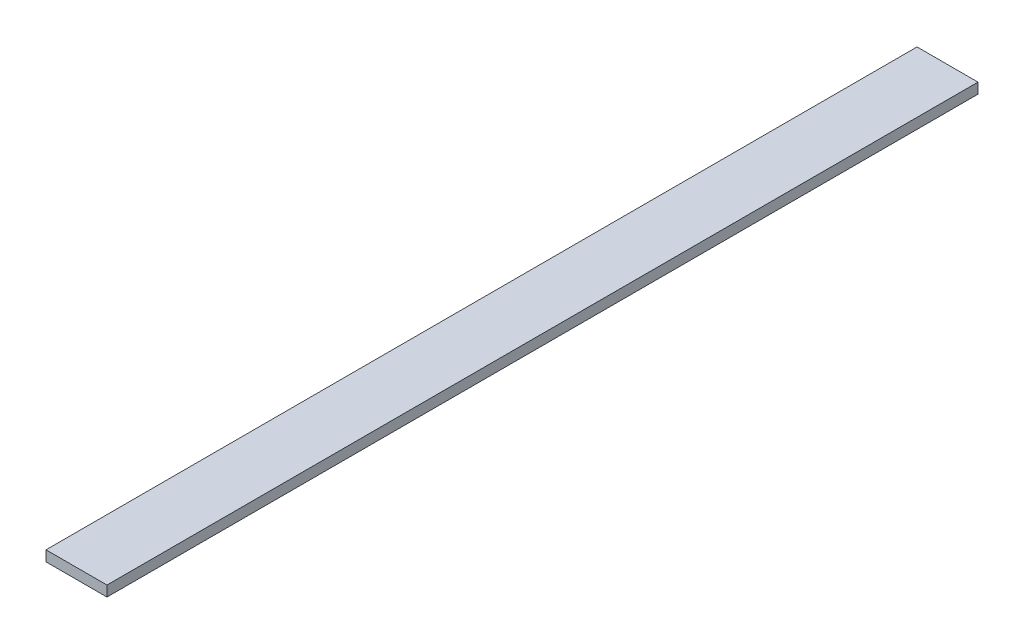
ISO-10303-21;
HEADER;
FILE_DESCRIPTION(('STEP AP214'),'2;1');
FILE_NAME('part.step','',(''),(''),'','','');
FILE_SCHEMA(('AUTOMOTIVE_DESIGN { 1 0 10303 214 1 1 1 1 }'));
ENDSEC;
DATA;
#1=APPLICATION_CONTEXT('core data for automotive mechanical design processes');
#2=APPLICATION_PROTOCOL_DEFINITION('international standard','automotive_design',2000,#1);
#3=PRODUCT_CONTEXT('',#1,'mechanical');
#4=PRODUCT('Part','Part','',(#3));
#5=PRODUCT_RELATED_PRODUCT_CATEGORY('part','',(#4));
#6=PRODUCT_DEFINITION_FORMATION('','',#4);
#7=PRODUCT_DEFINITION_CONTEXT('part definition',#1,'design');
#8=PRODUCT_DEFINITION('design','',#6,#7);
#9=PRODUCT_DEFINITION_SHAPE('','',#8);
#10=(LENGTH_UNIT() NAMED_UNIT(*) SI_UNIT(.MILLI.,.METRE.));
#11=(NAMED_UNIT(*) PLANE_ANGLE_UNIT() SI_UNIT($,.RADIAN.));
#12=(NAMED_UNIT(*) SI_UNIT($,.STERADIAN.) SOLID_ANGLE_UNIT());
#13=UNCERTAINTY_MEASURE_WITH_UNIT(LENGTH_MEASURE(1.E-05),#10,'distance_accuracy_value','');
#14=(GEOMETRIC_REPRESENTATION_CONTEXT(3) GLOBAL_UNCERTAINTY_ASSIGNED_CONTEXT((#13)) GLOBAL_UNIT_ASSIGNED_CONTEXT((#10,
#11,#12)) REPRESENTATION_CONTEXT('',''));
#15=CARTESIAN_POINT('',(0.,0.,0.));
#16=DIRECTION('',(0.,0.,1.));
#17=DIRECTION('',(1.,0.,0.));
#18=AXIS2_PLACEMENT_3D('',#15,#16,#17);
#19=CARTESIAN_POINT('',(17.5,0.,0.));
#20=DIRECTION('',(-1.,0.,0.));
#21=DIRECTION('',(0.,0.,1.));
#22=AXIS2_PLACEMENT_3D('',#19,#20,#21);
#23=PLANE('',#22);
#24=DIRECTION('',(0.,-1.,0.));
#25=VECTOR('',#24,1.);
#26=CARTESIAN_POINT('',(17.5,3.,0.));
#27=LINE('',#26,#25);
#28=CARTESIAN_POINT('',(17.5,6.,0.));
#29=VERTEX_POINT('',#28);
#30=CARTESIAN_POINT('',(17.5,0.,0.));
#31=VERTEX_POINT('',#30);
#32=EDGE_CURVE('E51',#29,#31,#27,.T.);
#33=ORIENTED_EDGE('',*,*,#32,.F.);
#34=DIRECTION('',(0.,0.,-1.));
#35=VECTOR('',#34,1.);
#36=CARTESIAN_POINT('',(17.5,6.,250.));
#37=LINE('',#36,#35);
#38=CARTESIAN_POINT('',(17.5,6.,500.));
#39=VERTEX_POINT('',#38);
#40=EDGE_CURVE('E66',#39,#29,#37,.T.);
#41=ORIENTED_EDGE('',*,*,#40,.F.);
#42=DIRECTION('',(0.,-1.,0.));
#43=VECTOR('',#42,1.);
#44=CARTESIAN_POINT('',(17.5,3.,500.));
#45=LINE('',#44,#43);
#46=CARTESIAN_POINT('',(17.5,0.,500.));
#47=VERTEX_POINT('',#46);
#48=EDGE_CURVE('E18',#39,#47,#45,.T.);
#49=ORIENTED_EDGE('',*,*,#48,.T.);
#50=DIRECTION('',(0.,0.,1.));
#51=VECTOR('',#50,1.);
#52=CARTESIAN_POINT('',(17.5,0.,250.));
#53=LINE('',#52,#51);
#54=EDGE_CURVE('E56',#31,#47,#53,.T.);
#55=ORIENTED_EDGE('',*,*,#54,.F.);
#56=EDGE_LOOP('',(#33,#41,#49,#55));
#57=FACE_BOUND('',#56,.T.);
#58=ADVANCED_FACE('F14',(#57),#23,.F.);
#59=CARTESIAN_POINT('',(17.5,0.,500.));
#60=DIRECTION('',(0.,0.,-1.));
#61=DIRECTION('',(-1.,0.,0.));
#62=AXIS2_PLACEMENT_3D('',#59,#60,#61);
#63=PLANE('',#62);
#64=DIRECTION('',(-1.,0.,0.));
#65=VECTOR('',#64,1.);
#66=CARTESIAN_POINT('',(0.,0.,500.));
#67=LINE('',#66,#65);
#68=CARTESIAN_POINT('',(-17.5,0.,500.));
#69=VERTEX_POINT('',#68);
#70=EDGE_CURVE('E61',#47,#69,#67,.T.);
#71=ORIENTED_EDGE('',*,*,#70,.F.);
#72=ORIENTED_EDGE('',*,*,#48,.F.);
#73=DIRECTION('',(1.,0.,0.));
#74=VECTOR('',#73,1.);
#75=CARTESIAN_POINT('',(0.,6.,500.));
#76=LINE('',#75,#74);
#77=CARTESIAN_POINT('',(-17.5,6.,500.));
#78=VERTEX_POINT('',#77);
#79=EDGE_CURVE('E79',#78,#39,#76,.T.);
#80=ORIENTED_EDGE('',*,*,#79,.F.);
#81=DIRECTION('',(0.,-1.,0.));
#82=VECTOR('',#81,1.);
#83=CARTESIAN_POINT('',(-17.5,3.,500.));
#84=LINE('',#83,#82);
#85=EDGE_CURVE('E72',#78,#69,#84,.T.);
#86=ORIENTED_EDGE('',*,*,#85,.T.);
#87=EDGE_LOOP('',(#71,#72,#80,#86));
#88=FACE_BOUND('',#87,.T.);
#89=ADVANCED_FACE('F71',(#88),#63,.F.);
#90=CARTESIAN_POINT('',(-17.5,0.,500.));
#91=DIRECTION('',(0.,-1.,0.));
#92=DIRECTION('',(0.,0.,-1.));
#93=AXIS2_PLACEMENT_3D('',#90,#91,#92);
#94=PLANE('',#93);
#95=ORIENTED_EDGE('',*,*,#70,.T.);
#96=DIRECTION('',(0.,0.,-1.));
#97=VECTOR('',#96,1.);
#98=CARTESIAN_POINT('',(-17.5,0.,250.));
#99=LINE('',#98,#97);
#100=CARTESIAN_POINT('',(-17.5,0.,0.));
#101=VERTEX_POINT('',#100);
#102=EDGE_CURVE('E82',#69,#101,#99,.T.);
#103=ORIENTED_EDGE('',*,*,#102,.T.);
#104=DIRECTION('',(-1.,0.,0.));
#105=VECTOR('',#104,1.);
#106=CARTESIAN_POINT('',(0.,0.,0.));
#107=LINE('',#106,#105);
#108=EDGE_CURVE('E63',#31,#101,#107,.T.);
#109=ORIENTED_EDGE('',*,*,#108,.F.);
#110=ORIENTED_EDGE('',*,*,#54,.T.);
#111=EDGE_LOOP('',(#95,#103,#109,#110));
#112=FACE_BOUND('',#111,.T.);
#113=ADVANCED_FACE('F58',(#112),#94,.T.);
#114=CARTESIAN_POINT('',(17.5,0.,0.));
#115=DIRECTION('',(0.,0.,-1.));
#116=DIRECTION('',(-1.,0.,0.));
#117=AXIS2_PLACEMENT_3D('',#114,#115,#116);
#118=PLANE('',#117);
#119=ORIENTED_EDGE('',*,*,#32,.T.);
#120=ORIENTED_EDGE('',*,*,#108,.T.);
#121=DIRECTION('',(0.,1.,0.));
#122=VECTOR('',#121,1.);
#123=CARTESIAN_POINT('',(-17.5,3.,0.));
#124=LINE('',#123,#122);
#125=CARTESIAN_POINT('',(-17.5,6.,0.));
#126=VERTEX_POINT('',#125);
#127=EDGE_CURVE('E24',#101,#126,#124,.T.);
#128=ORIENTED_EDGE('',*,*,#127,.T.);
#129=DIRECTION('',(-1.,0.,0.));
#130=VECTOR('',#129,1.);
#131=CARTESIAN_POINT('',(0.,6.,0.));
#132=LINE('',#131,#130);
#133=EDGE_CURVE('E32',#29,#126,#132,.T.);
#134=ORIENTED_EDGE('',*,*,#133,.F.);
#135=EDGE_LOOP('',(#119,#120,#128,#134));
#136=FACE_BOUND('',#135,.T.);
#137=ADVANCED_FACE('F86',(#136),#118,.T.);
#138=CARTESIAN_POINT('',(17.5,6.,0.));
#139=DIRECTION('',(0.,1.,0.));
#140=DIRECTION('',(-1.,0.,0.));
#141=AXIS2_PLACEMENT_3D('',#138,#139,#140);
#142=PLANE('',#141);
#143=DIRECTION('',(0.,0.,1.));
#144=VECTOR('',#143,1.);
#145=CARTESIAN_POINT('',(-17.5,6.,250.));
#146=LINE('',#145,#144);
#147=EDGE_CURVE('E9',#126,#78,#146,.T.);
#148=ORIENTED_EDGE('',*,*,#147,.T.);
#149=ORIENTED_EDGE('',*,*,#79,.T.);
#150=ORIENTED_EDGE('',*,*,#40,.T.);
#151=ORIENTED_EDGE('',*,*,#133,.T.);
#152=EDGE_LOOP('',(#148,#149,#150,#151));
#153=FACE_BOUND('',#152,.T.);
#154=ADVANCED_FACE('F88',(#153),#142,.T.);
#155=CARTESIAN_POINT('',(-17.5,0.,500.));
#156=DIRECTION('',(1.,0.,0.));
#157=DIRECTION('',(0.,0.,-1.));
#158=AXIS2_PLACEMENT_3D('',#155,#156,#157);
#159=PLANE('',#158);
#160=ORIENTED_EDGE('',*,*,#127,.F.);
#161=ORIENTED_EDGE('',*,*,#102,.F.);
#162=ORIENTED_EDGE('',*,*,#85,.F.);
#163=ORIENTED_EDGE('',*,*,#147,.F.);
#164=EDGE_LOOP('',(#160,#161,#162,#163));
#165=FACE_BOUND('',#164,.T.);
#166=ADVANCED_FACE('F16',(#165),#159,.F.);
#167=CLOSED_SHELL('',(#58,#89,#113,#137,#154,#166));
#168=MANIFOLD_SOLID_BREP('B1',#167);
#169=ADVANCED_BREP_SHAPE_REPRESENTATION('',(#18,#168),#14);
#170=SHAPE_DEFINITION_REPRESENTATION(#9,#169);
ENDSEC;
END-ISO-10303-21;
